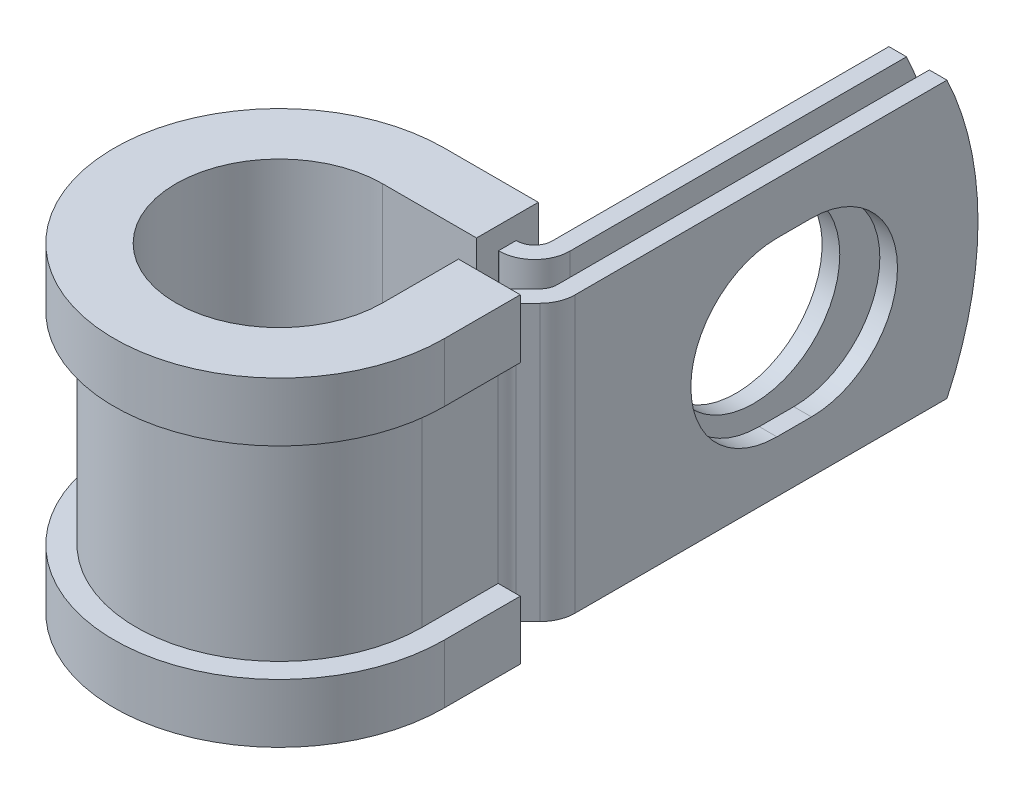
ISO-10303-21;
HEADER;
FILE_DESCRIPTION(('STEP AP214'),'2;1');
FILE_NAME('part.step','',(''),(''),'','','');
FILE_SCHEMA(('AUTOMOTIVE_DESIGN { 1 0 10303 214 1 1 1 1 }'));
ENDSEC;
DATA;
#1=APPLICATION_CONTEXT('core data for automotive mechanical design processes');
#2=APPLICATION_PROTOCOL_DEFINITION('international standard','automotive_design',2000,#1);
#3=PRODUCT_CONTEXT('',#1,'mechanical');
#4=PRODUCT('Part','Part','',(#3));
#5=PRODUCT_RELATED_PRODUCT_CATEGORY('part','',(#4));
#6=PRODUCT_DEFINITION_FORMATION('','',#4);
#7=PRODUCT_DEFINITION_CONTEXT('part definition',#1,'design');
#8=PRODUCT_DEFINITION('design','',#6,#7);
#9=PRODUCT_DEFINITION_SHAPE('','',#8);
#10=(LENGTH_UNIT() NAMED_UNIT(*) SI_UNIT(.MILLI.,.METRE.));
#11=(NAMED_UNIT(*) PLANE_ANGLE_UNIT() SI_UNIT($,.RADIAN.));
#12=(NAMED_UNIT(*) SI_UNIT($,.STERADIAN.) SOLID_ANGLE_UNIT());
#13=UNCERTAINTY_MEASURE_WITH_UNIT(LENGTH_MEASURE(1.E-05),#10,'distance_accuracy_value','');
#14=(GEOMETRIC_REPRESENTATION_CONTEXT(3) GLOBAL_UNCERTAINTY_ASSIGNED_CONTEXT((#13)) GLOBAL_UNIT_ASSIGNED_CONTEXT((#10,
#11,#12)) REPRESENTATION_CONTEXT('',''));
#15=CARTESIAN_POINT('',(0.,0.,0.));
#16=DIRECTION('',(0.,0.,1.));
#17=DIRECTION('',(1.,0.,0.));
#18=AXIS2_PLACEMENT_3D('',#15,#16,#17);
#19=CARTESIAN_POINT('',(9.33966980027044,-9.525,-8.6614));
#20=DIRECTION('',(0.,1.,0.));
#21=DIRECTION('',(1.,0.,0.));
#22=AXIS2_PLACEMENT_3D('',#19,#20,#21);
#23=PLANE('',#22);
#24=DIRECTION('',(0.,0.,-1.));
#25=VECTOR('',#24,1.);
#26=CARTESIAN_POINT('',(6.49486980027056,-9.525,-8.6614));
#27=LINE('',#26,#25);
#28=CARTESIAN_POINT('',(6.49486980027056,-9.525,-8.6614));
#29=VERTEX_POINT('',#28);
#30=CARTESIAN_POINT('',(6.49486980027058,-9.525,-9.8806));
#31=VERTEX_POINT('',#30);
#32=EDGE_CURVE('E524',#29,#31,#27,.T.);
#33=ORIENTED_EDGE('',*,*,#32,.T.);
#34=DIRECTION('',(1.,0.,0.));
#35=VECTOR('',#34,1.);
#36=CARTESIAN_POINT('',(0.,-9.525,-9.8806));
#37=LINE('',#36,#35);
#38=CARTESIAN_POINT('',(6.54566980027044,-9.525,-9.8806));
#39=VERTEX_POINT('',#38);
#40=EDGE_CURVE('E411',#39,#31,#37,.F.);
#41=ORIENTED_EDGE('',*,*,#40,.F.);
#42=CARTESIAN_POINT('',(6.54566980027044,-9.525,-11.0998));
#43=DIRECTION('',(0.,1.,0.));
#44=DIRECTION('',(1.,0.,0.));
#45=AXIS2_PLACEMENT_3D('',#42,#43,#44);
#46=CIRCLE('',#45,1.2192);
#47=CARTESIAN_POINT('',(7.76486980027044,-9.525,-11.0998));
#48=VERTEX_POINT('',#47);
#49=EDGE_CURVE('E409',#48,#39,#46,.F.);
#50=ORIENTED_EDGE('',*,*,#49,.F.);
#51=DIRECTION('',(0.,0.,1.));
#52=VECTOR('',#51,1.);
#53=CARTESIAN_POINT('',(7.76486980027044,-9.525,-36.4998));
#54=LINE('',#53,#52);
#55=CARTESIAN_POINT('',(7.76486980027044,-9.525,-34.3552631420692));
#56=VERTEX_POINT('',#55);
#57=EDGE_CURVE('E407',#56,#48,#54,.T.);
#58=ORIENTED_EDGE('',*,*,#57,.F.);
#59=DIRECTION('',(-1.,0.,0.));
#60=VECTOR('',#59,1.);
#61=CARTESIAN_POINT('',(11.7780698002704,-9.525,-34.3552631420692));
#62=LINE('',#61,#60);
#63=CARTESIAN_POINT('',(8.98406980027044,-9.525,-34.3552631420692));
#64=VERTEX_POINT('',#63);
#65=EDGE_CURVE('E12',#64,#56,#62,.T.);
#66=ORIENTED_EDGE('',*,*,#65,.F.);
#67=DIRECTION('',(0.,0.,1.));
#68=VECTOR('',#67,1.);
#69=CARTESIAN_POINT('',(8.98406980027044,-9.525,-36.4998));
#70=LINE('',#69,#68);
#71=CARTESIAN_POINT('',(8.98406980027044,-9.525,-11.0998));
#72=VERTEX_POINT('',#71);
#73=EDGE_CURVE('E405',#64,#72,#70,.T.);
#74=ORIENTED_EDGE('',*,*,#73,.T.);
#75=CARTESIAN_POINT('',(6.54566980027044,-9.525,-11.0998));
#76=DIRECTION('',(0.,-1.,0.));
#77=DIRECTION('',(0.,0.,1.));
#78=AXIS2_PLACEMENT_3D('',#75,#76,#77);
#79=CIRCLE('',#78,2.4384);
#80=CARTESIAN_POINT('',(6.54566980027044,-9.525,-8.6614));
#81=VERTEX_POINT('',#80);
#82=EDGE_CURVE('E402',#72,#81,#79,.T.);
#83=ORIENTED_EDGE('',*,*,#82,.T.);
#84=DIRECTION('',(-1.,0.,0.));
#85=VECTOR('',#84,1.);
#86=CARTESIAN_POINT('',(0.,-9.525,-8.6614));
#87=LINE('',#86,#85);
#88=EDGE_CURVE('E399',#81,#29,#87,.T.);
#89=ORIENTED_EDGE('',*,*,#88,.T.);
#90=EDGE_LOOP('',(#33,#41,#50,#58,#66,#74,#83,#89));
#91=FACE_BOUND('',#90,.T.);
#92=ADVANCED_FACE('F55',(#91),#23,.F.);
#93=CARTESIAN_POINT('',(9.33966980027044,9.525,-8.6614));
#94=DIRECTION('',(0.,1.,0.));
#95=DIRECTION('',(1.,0.,0.));
#96=AXIS2_PLACEMENT_3D('',#93,#94,#95);
#97=PLANE('',#96);
#98=DIRECTION('',(1.,0.,0.));
#99=VECTOR('',#98,1.);
#100=CARTESIAN_POINT('',(0.,9.525,-9.8806));
#101=LINE('',#100,#99);
#102=CARTESIAN_POINT('',(6.54566980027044,9.525,-9.8806));
#103=VERTEX_POINT('',#102);
#104=CARTESIAN_POINT('',(6.49486980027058,9.525,-9.8806));
#105=VERTEX_POINT('',#104);
#106=EDGE_CURVE('E369',#103,#105,#101,.F.);
#107=ORIENTED_EDGE('',*,*,#106,.T.);
#108=DIRECTION('',(0.,0.,1.));
#109=VECTOR('',#108,1.);
#110=CARTESIAN_POINT('',(6.49486980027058,9.525,-9.8806));
#111=LINE('',#110,#109);
#112=CARTESIAN_POINT('',(6.49486980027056,9.525,-8.6614));
#113=VERTEX_POINT('',#112);
#114=EDGE_CURVE('E518',#105,#113,#111,.T.);
#115=ORIENTED_EDGE('',*,*,#114,.T.);
#116=DIRECTION('',(-1.,0.,0.));
#117=VECTOR('',#116,1.);
#118=CARTESIAN_POINT('',(0.,9.525,-8.6614));
#119=LINE('',#118,#117);
#120=CARTESIAN_POINT('',(6.54566980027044,9.525,-8.6614));
#121=VERTEX_POINT('',#120);
#122=EDGE_CURVE('E626',#121,#113,#119,.T.);
#123=ORIENTED_EDGE('',*,*,#122,.F.);
#124=CARTESIAN_POINT('',(6.54566980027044,9.525,-11.0998));
#125=DIRECTION('',(0.,-1.,0.));
#126=DIRECTION('',(0.,0.,1.));
#127=AXIS2_PLACEMENT_3D('',#124,#125,#126);
#128=CIRCLE('',#127,2.4384);
#129=CARTESIAN_POINT('',(8.98406980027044,9.525,-11.0998));
#130=VERTEX_POINT('',#129);
#131=EDGE_CURVE('E371',#130,#121,#128,.T.);
#132=ORIENTED_EDGE('',*,*,#131,.F.);
#133=DIRECTION('',(0.,0.,1.));
#134=VECTOR('',#133,1.);
#135=CARTESIAN_POINT('',(8.98406980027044,9.525,-36.4998));
#136=LINE('',#135,#134);
#137=CARTESIAN_POINT('',(8.98406980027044,9.525,-34.3552631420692));
#138=VERTEX_POINT('',#137);
#139=EDGE_CURVE('E362',#138,#130,#136,.T.);
#140=ORIENTED_EDGE('',*,*,#139,.F.);
#141=DIRECTION('',(-1.,0.,0.));
#142=VECTOR('',#141,1.);
#143=CARTESIAN_POINT('',(11.7780698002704,9.525,-34.3552631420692));
#144=LINE('',#143,#142);
#145=CARTESIAN_POINT('',(7.76486980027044,9.525,-34.3552631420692));
#146=VERTEX_POINT('',#145);
#147=EDGE_CURVE('E63',#138,#146,#144,.T.);
#148=ORIENTED_EDGE('',*,*,#147,.T.);
#149=DIRECTION('',(0.,0.,1.));
#150=VECTOR('',#149,1.);
#151=CARTESIAN_POINT('',(7.76486980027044,9.525,-36.4998));
#152=LINE('',#151,#150);
#153=CARTESIAN_POINT('',(7.76486980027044,9.525,-11.0998));
#154=VERTEX_POINT('',#153);
#155=EDGE_CURVE('E359',#146,#154,#152,.T.);
#156=ORIENTED_EDGE('',*,*,#155,.T.);
#157=CARTESIAN_POINT('',(6.54566980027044,9.525,-11.0998));
#158=DIRECTION('',(0.,1.,0.));
#159=DIRECTION('',(1.,0.,0.));
#160=AXIS2_PLACEMENT_3D('',#157,#158,#159);
#161=CIRCLE('',#160,1.2192);
#162=EDGE_CURVE('E367',#154,#103,#161,.F.);
#163=ORIENTED_EDGE('',*,*,#162,.T.);
#164=EDGE_LOOP('',(#107,#115,#123,#132,#140,#148,#156,#163));
#165=FACE_BOUND('',#164,.T.);
#166=ADVANCED_FACE('F358',(#165),#97,.T.);
#167=CARTESIAN_POINT('',(0.,9.525,-8.6614));
#168=DIRECTION('',(0.,0.,1.));
#169=DIRECTION('',(1.,0.,0.));
#170=AXIS2_PLACEMENT_3D('',#167,#168,#169);
#171=PLANE('',#170);
#172=ORIENTED_EDGE('',*,*,#122,.T.);
#173=DIRECTION('',(0.,-1.,0.));
#174=VECTOR('',#173,1.);
#175=CARTESIAN_POINT('',(6.49486980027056,9.525,-8.6614));
#176=LINE('',#175,#174);
#177=EDGE_CURVE('E521',#113,#29,#176,.T.);
#178=ORIENTED_EDGE('',*,*,#177,.T.);
#179=ORIENTED_EDGE('',*,*,#88,.F.);
#180=DIRECTION('',(0.,-1.,0.));
#181=VECTOR('',#180,1.);
#182=CARTESIAN_POINT('',(6.54566980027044,9.525,-8.6614));
#183=LINE('',#182,#181);
#184=EDGE_CURVE('E345',#121,#81,#183,.T.);
#185=ORIENTED_EDGE('',*,*,#184,.F.);
#186=EDGE_LOOP('',(#172,#178,#179,#185));
#187=FACE_BOUND('',#186,.T.);
#188=ADVANCED_FACE('F636',(#187),#171,.T.);
#189=CARTESIAN_POINT('',(11.7780698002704,9.525,-8.6614));
#190=DIRECTION('',(-1.,0.,0.));
#191=DIRECTION('',(0.,0.,1.));
#192=AXIS2_PLACEMENT_3D('',#189,#190,#191);
#193=PLANE('',#192);
#194=CARTESIAN_POINT('',(11.7780698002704,0.,-24.9935999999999));
#195=DIRECTION('',(1.,0.,0.));
#196=DIRECTION('',(0.,0.,-1.));
#197=AXIS2_PLACEMENT_3D('',#194,#195,#196);
#198=CIRCLE('',#197,5.9436);
#199=CARTESIAN_POINT('',(11.7780698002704,-5.9436,-24.9936000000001));
#200=VERTEX_POINT('',#199);
#201=CARTESIAN_POINT('',(11.7780698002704,5.9436,-24.9936000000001));
#202=VERTEX_POINT('',#201);
#203=EDGE_CURVE('E581',#200,#202,#198,.T.);
#204=ORIENTED_EDGE('',*,*,#203,.F.);
#205=DIRECTION('',(0.,0.,-1.));
#206=VECTOR('',#205,1.);
#207=CARTESIAN_POINT('',(11.7780698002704,-5.9436,-22.6059999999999));
#208=LINE('',#207,#206);
#209=CARTESIAN_POINT('',(11.7780698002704,-5.9436,-22.6059999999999));
#210=VERTEX_POINT('',#209);
#211=EDGE_CURVE('E584',#210,#200,#208,.T.);
#212=ORIENTED_EDGE('',*,*,#211,.F.);
#213=CARTESIAN_POINT('',(11.7780698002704,0.,-22.6059999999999));
#214=DIRECTION('',(1.,0.,0.));
#215=DIRECTION('',(0.,0.,-1.));
#216=AXIS2_PLACEMENT_3D('',#213,#214,#215);
#217=CIRCLE('',#216,5.9436);
#218=CARTESIAN_POINT('',(11.7780698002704,5.9436,-22.6059999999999));
#219=VERTEX_POINT('',#218);
#220=EDGE_CURVE('E577',#219,#210,#217,.T.);
#221=ORIENTED_EDGE('',*,*,#220,.F.);
#222=DIRECTION('',(0.,0.,1.));
#223=VECTOR('',#222,1.);
#224=CARTESIAN_POINT('',(11.7780698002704,5.9436,-22.6059999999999));
#225=LINE('',#224,#223);
#226=EDGE_CURVE('E578',#202,#219,#225,.T.);
#227=ORIENTED_EDGE('',*,*,#226,.F.);
#228=EDGE_LOOP('',(#204,#212,#221,#227));
#229=FACE_BOUND('',#228,.T.);
#230=DIRECTION('',(0.,0.,-1.));
#231=VECTOR('',#230,1.);
#232=CARTESIAN_POINT('',(11.7780698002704,-9.525,-8.6614));
#233=LINE('',#232,#231);
#234=CARTESIAN_POINT('',(11.7780698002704,-9.525,-8.6614));
#235=VERTEX_POINT('',#234);
#236=CARTESIAN_POINT('',(11.7780698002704,-9.525,-34.3552631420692));
#237=VERTEX_POINT('',#236);
#238=EDGE_CURVE('E383',#235,#237,#233,.T.);
#239=ORIENTED_EDGE('',*,*,#238,.T.);
#240=CARTESIAN_POINT('',(11.7780698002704,0.,-14.2748));
#241=DIRECTION('',(-1.,0.,0.));
#242=DIRECTION('',(0.,0.,1.));
#243=AXIS2_PLACEMENT_3D('',#240,#241,#242);
#244=CIRCLE('',#243,22.225);
#245=CARTESIAN_POINT('',(11.7780698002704,9.525,-34.3552631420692));
#246=VERTEX_POINT('',#245);
#247=EDGE_CURVE('E569',#246,#237,#244,.T.);
#248=ORIENTED_EDGE('',*,*,#247,.F.);
#249=DIRECTION('',(0.,0.,-1.));
#250=VECTOR('',#249,1.);
#251=CARTESIAN_POINT('',(11.7780698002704,9.525,-8.6614));
#252=LINE('',#251,#250);
#253=CARTESIAN_POINT('',(11.7780698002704,9.525,-8.6614));
#254=VERTEX_POINT('',#253);
#255=EDGE_CURVE('E420',#254,#246,#252,.T.);
#256=ORIENTED_EDGE('',*,*,#255,.F.);
#257=DIRECTION('',(0.,-1.,0.));
#258=VECTOR('',#257,1.);
#259=CARTESIAN_POINT('',(11.7780698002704,9.525,-8.6614));
#260=LINE('',#259,#258);
#261=EDGE_CURVE('E382',#254,#235,#260,.T.);
#262=ORIENTED_EDGE('',*,*,#261,.T.);
#263=EDGE_LOOP('',(#239,#248,#256,#262));
#264=FACE_BOUND('',#263,.T.);
#265=ADVANCED_FACE('F57',(#229,#264),#193,.F.);
#266=CARTESIAN_POINT('',(10.5588698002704,9.525,-8.6614));
#267=DIRECTION('',(-1.,0.,0.));
#268=DIRECTION('',(0.,0.,1.));
#269=AXIS2_PLACEMENT_3D('',#266,#267,#268);
#270=PLANE('',#269);
#271=DIRECTION('',(0.,0.,-1.));
#272=VECTOR('',#271,1.);
#273=CARTESIAN_POINT('',(10.5588698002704,-5.9436,-22.6059999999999));
#274=LINE('',#273,#272);
#275=CARTESIAN_POINT('',(10.5588698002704,-5.9436,-22.6059999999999));
#276=VERTEX_POINT('',#275);
#277=CARTESIAN_POINT('',(10.5588698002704,-5.9436,-24.9936000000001));
#278=VERTEX_POINT('',#277);
#279=EDGE_CURVE('E580',#276,#278,#274,.T.);
#280=ORIENTED_EDGE('',*,*,#279,.T.);
#281=CARTESIAN_POINT('',(10.5588698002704,0.,-24.9935999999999));
#282=DIRECTION('',(-1.,0.,0.));
#283=DIRECTION('',(0.,0.,1.));
#284=AXIS2_PLACEMENT_3D('',#281,#282,#283);
#285=CIRCLE('',#284,5.9436);
#286=CARTESIAN_POINT('',(10.5588698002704,5.9436,-24.9936000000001));
#287=VERTEX_POINT('',#286);
#288=EDGE_CURVE('E601',#278,#287,#285,.F.);
#289=ORIENTED_EDGE('',*,*,#288,.T.);
#290=DIRECTION('',(0.,0.,1.));
#291=VECTOR('',#290,1.);
#292=CARTESIAN_POINT('',(10.5588698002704,5.9436,-22.6059999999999));
#293=LINE('',#292,#291);
#294=CARTESIAN_POINT('',(10.5588698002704,5.9436,-22.6059999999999));
#295=VERTEX_POINT('',#294);
#296=EDGE_CURVE('E597',#287,#295,#293,.T.);
#297=ORIENTED_EDGE('',*,*,#296,.T.);
#298=CARTESIAN_POINT('',(10.5588698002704,0.,-22.6059999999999));
#299=DIRECTION('',(-1.,0.,0.));
#300=DIRECTION('',(0.,0.,1.));
#301=AXIS2_PLACEMENT_3D('',#298,#299,#300);
#302=CIRCLE('',#301,5.9436);
#303=EDGE_CURVE('E592',#295,#276,#302,.F.);
#304=ORIENTED_EDGE('',*,*,#303,.T.);
#305=EDGE_LOOP('',(#280,#289,#297,#304));
#306=FACE_BOUND('',#305,.T.);
#307=CARTESIAN_POINT('',(10.5588698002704,0.,-14.2748));
#308=DIRECTION('',(-1.,0.,0.));
#309=DIRECTION('',(0.,0.,1.));
#310=AXIS2_PLACEMENT_3D('',#307,#308,#309);
#311=CIRCLE('',#310,22.225);
#312=CARTESIAN_POINT('',(10.5588698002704,9.525,-34.3552631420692));
#313=VERTEX_POINT('',#312);
#314=CARTESIAN_POINT('',(10.5588698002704,-9.525,-34.3552631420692));
#315=VERTEX_POINT('',#314);
#316=EDGE_CURVE('E77',#313,#315,#311,.T.);
#317=ORIENTED_EDGE('',*,*,#316,.T.);
#318=DIRECTION('',(0.,0.,-1.));
#319=VECTOR('',#318,1.);
#320=CARTESIAN_POINT('',(10.5588698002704,-9.525,-8.6614));
#321=LINE('',#320,#319);
#322=CARTESIAN_POINT('',(10.5588698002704,-9.525,-8.6614));
#323=VERTEX_POINT('',#322);
#324=EDGE_CURVE('E386',#323,#315,#321,.T.);
#325=ORIENTED_EDGE('',*,*,#324,.F.);
#326=DIRECTION('',(0.,-1.,0.));
#327=VECTOR('',#326,1.);
#328=CARTESIAN_POINT('',(10.5588698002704,9.525,-8.6614));
#329=LINE('',#328,#327);
#330=CARTESIAN_POINT('',(10.5588698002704,9.525,-8.6614));
#331=VERTEX_POINT('',#330);
#332=EDGE_CURVE('E353',#331,#323,#329,.T.);
#333=ORIENTED_EDGE('',*,*,#332,.F.);
#334=DIRECTION('',(0.,0.,-1.));
#335=VECTOR('',#334,1.);
#336=CARTESIAN_POINT('',(10.5588698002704,9.525,-8.6614));
#337=LINE('',#336,#335);
#338=EDGE_CURVE('E616',#331,#313,#337,.T.);
#339=ORIENTED_EDGE('',*,*,#338,.T.);
#340=EDGE_LOOP('',(#317,#325,#333,#339));
#341=FACE_BOUND('',#340,.T.);
#342=ADVANCED_FACE('F690',(#306,#341),#270,.T.);
#343=CARTESIAN_POINT('',(8.98406980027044,9.525,-36.4998));
#344=DIRECTION('',(1.,0.,0.));
#345=DIRECTION('',(0.,0.,-1.));
#346=AXIS2_PLACEMENT_3D('',#343,#344,#345);
#347=PLANE('',#346);
#348=CARTESIAN_POINT('',(8.98406980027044,0.,-23.7998));
#349=DIRECTION('',(1.,0.,0.));
#350=DIRECTION('',(0.,0.,-1.));
#351=AXIS2_PLACEMENT_3D('',#348,#349,#350);
#352=CIRCLE('',#351,5.9436);
#353=CARTESIAN_POINT('',(8.98406980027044,0.,-29.7434));
#354=VERTEX_POINT('',#353);
#355=EDGE_CURVE('E387',#354,#354,#352,.F.);
#356=ORIENTED_EDGE('',*,*,#355,.T.);
#357=EDGE_LOOP('',(#356));
#358=FACE_BOUND('',#357,.T.);
#359=ORIENTED_EDGE('',*,*,#73,.F.);
#360=CARTESIAN_POINT('',(8.98406980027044,0.,-14.2748));
#361=DIRECTION('',(1.,0.,0.));
#362=DIRECTION('',(0.,0.,-1.));
#363=AXIS2_PLACEMENT_3D('',#360,#361,#362);
#364=CIRCLE('',#363,22.225);
#365=EDGE_CURVE('E574',#64,#138,#364,.T.);
#366=ORIENTED_EDGE('',*,*,#365,.T.);
#367=ORIENTED_EDGE('',*,*,#139,.T.);
#368=DIRECTION('',(0.,-1.,0.));
#369=VECTOR('',#368,1.);
#370=CARTESIAN_POINT('',(8.98406980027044,9.525,-11.0998));
#371=LINE('',#370,#369);
#372=EDGE_CURVE('E342',#130,#72,#371,.T.);
#373=ORIENTED_EDGE('',*,*,#372,.T.);
#374=EDGE_LOOP('',(#359,#366,#367,#373));
#375=FACE_BOUND('',#374,.T.);
#376=ADVANCED_FACE('F642',(#358,#375),#347,.T.);
#377=CARTESIAN_POINT('',(7.76486980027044,9.525,-36.4998));
#378=DIRECTION('',(1.,0.,0.));
#379=DIRECTION('',(0.,0.,-1.));
#380=AXIS2_PLACEMENT_3D('',#377,#378,#379);
#381=PLANE('',#380);
#382=CARTESIAN_POINT('',(7.76486980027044,0.,-23.7998));
#383=DIRECTION('',(-1.,0.,0.));
#384=DIRECTION('',(0.,0.,1.));
#385=AXIS2_PLACEMENT_3D('',#382,#383,#384);
#386=CIRCLE('',#385,5.9436);
#387=CARTESIAN_POINT('',(7.76486980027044,0.,-17.8562));
#388=VERTEX_POINT('',#387);
#389=EDGE_CURVE('E609',#388,#388,#386,.T.);
#390=ORIENTED_EDGE('',*,*,#389,.F.);
#391=EDGE_LOOP('',(#390));
#392=FACE_BOUND('',#391,.T.);
#393=CARTESIAN_POINT('',(7.76486980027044,0.,-14.2748));
#394=DIRECTION('',(-1.,0.,0.));
#395=DIRECTION('',(0.,0.,1.));
#396=AXIS2_PLACEMENT_3D('',#393,#394,#395);
#397=CIRCLE('',#396,22.225);
#398=EDGE_CURVE('E69',#146,#56,#397,.T.);
#399=ORIENTED_EDGE('',*,*,#398,.T.);
#400=ORIENTED_EDGE('',*,*,#57,.T.);
#401=DIRECTION('',(0.,-1.,0.));
#402=VECTOR('',#401,1.);
#403=CARTESIAN_POINT('',(7.76486980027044,9.525,-11.0998));
#404=LINE('',#403,#402);
#405=EDGE_CURVE('E339',#154,#48,#404,.T.);
#406=ORIENTED_EDGE('',*,*,#405,.F.);
#407=ORIENTED_EDGE('',*,*,#155,.F.);
#408=EDGE_LOOP('',(#399,#400,#406,#407));
#409=FACE_BOUND('',#408,.T.);
#410=ADVANCED_FACE('F365',(#392,#409),#381,.F.);
#411=CARTESIAN_POINT('',(11.0998,-9.525,-5.24890267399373));
#412=DIRECTION('',(0.,1.,0.));
#413=DIRECTION('',(1.,0.,0.));
#414=AXIS2_PLACEMENT_3D('',#411,#412,#413);
#415=CIRCLE('',#414,1.2192);
#416=CARTESIAN_POINT('',(9.8806,-9.525,-5.24890267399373));
#417=VERTEX_POINT('',#416);
#418=CARTESIAN_POINT('',(10.2376954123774,-9.525,-6.11100726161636));
#419=VERTEX_POINT('',#418);
#420=EDGE_CURVE('E414',#417,#419,#415,.F.);
#421=ORIENTED_EDGE('',*,*,#420,.F.);
#422=DIRECTION('',(1.,0.,0.));
#423=VECTOR('',#422,1.);
#424=CARTESIAN_POINT('',(8.6614,-9.525,-5.24890267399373));
#425=LINE('',#424,#423);
#426=CARTESIAN_POINT('',(8.6614,-9.525,-5.24890267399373));
#427=VERTEX_POINT('',#426);
#428=EDGE_CURVE('E452',#427,#417,#425,.T.);
#429=ORIENTED_EDGE('',*,*,#428,.F.);
#430=CARTESIAN_POINT('',(11.0998,-9.525,-5.24890267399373));
#431=DIRECTION('',(0.,-1.,0.));
#432=DIRECTION('',(0.,0.,1.));
#433=AXIS2_PLACEMENT_3D('',#430,#431,#432);
#434=CIRCLE('',#433,2.4384);
#435=CARTESIAN_POINT('',(9.37559082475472,-9.525,-6.973111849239));
#436=VERTEX_POINT('',#435);
#437=EDGE_CURVE('E396',#427,#436,#434,.T.);
#438=ORIENTED_EDGE('',*,*,#437,.T.);
#439=DIRECTION('',(0.707106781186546,0.,-0.707106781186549));
#440=VECTOR('',#439,1.);
#441=CARTESIAN_POINT('',(9.37559082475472,-9.525,-6.973111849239));
#442=LINE('',#441,#440);
#443=CARTESIAN_POINT('',(10.2017743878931,-9.525,-7.79929541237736));
#444=VERTEX_POINT('',#443);
#445=EDGE_CURVE('E393',#436,#444,#442,.T.);
#446=ORIENTED_EDGE('',*,*,#445,.T.);
#447=CARTESIAN_POINT('',(9.33966980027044,-9.525,-8.6614));
#448=DIRECTION('',(0.,1.,0.));
#449=DIRECTION('',(0.,0.,1.));
#450=AXIS2_PLACEMENT_3D('',#447,#448,#449);
#451=CIRCLE('',#450,1.2192);
#452=EDGE_CURVE('E390',#444,#323,#451,.T.);
#453=ORIENTED_EDGE('',*,*,#452,.T.);
#454=ORIENTED_EDGE('',*,*,#324,.T.);
#455=DIRECTION('',(-1.,0.,0.));
#456=VECTOR('',#455,1.);
#457=CARTESIAN_POINT('',(11.7780698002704,-9.525,-34.3552631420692));
#458=LINE('',#457,#456);
#459=EDGE_CURVE('E567',#237,#315,#458,.T.);
#460=ORIENTED_EDGE('',*,*,#459,.F.);
#461=ORIENTED_EDGE('',*,*,#238,.F.);
#462=CARTESIAN_POINT('',(9.33966980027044,-9.525,-8.6614));
#463=DIRECTION('',(0.,1.,0.));
#464=DIRECTION('',(1.,0.,0.));
#465=AXIS2_PLACEMENT_3D('',#462,#463,#464);
#466=CIRCLE('',#465,2.4384);
#467=CARTESIAN_POINT('',(11.0638789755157,-9.525,-6.93719082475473));
#468=VERTEX_POINT('',#467);
#469=EDGE_CURVE('E418',#468,#235,#466,.T.);
#470=ORIENTED_EDGE('',*,*,#469,.F.);
#471=DIRECTION('',(0.707106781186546,0.,-0.707106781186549));
#472=VECTOR('',#471,1.);
#473=CARTESIAN_POINT('',(10.2376954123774,-9.525,-6.11100726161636));
#474=LINE('',#473,#472);
#475=EDGE_CURVE('E416',#419,#468,#474,.T.);
#476=ORIENTED_EDGE('',*,*,#475,.F.);
#477=EDGE_LOOP('',(#421,#429,#438,#446,#453,#454,#460,#461,#470,#476));
#478=FACE_BOUND('',#477,.T.);
#479=ADVANCED_FACE('F676',(#478),#23,.F.);
#480=DIRECTION('',(-1.,0.,0.));
#481=VECTOR('',#480,1.);
#482=CARTESIAN_POINT('',(9.8806,9.525,-5.24890267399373));
#483=LINE('',#482,#481);
#484=CARTESIAN_POINT('',(9.8806,9.525,-5.24890267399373));
#485=VERTEX_POINT('',#484);
#486=CARTESIAN_POINT('',(8.6614,9.525,-5.24890267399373));
#487=VERTEX_POINT('',#486);
#488=EDGE_CURVE('E441',#485,#487,#483,.T.);
#489=ORIENTED_EDGE('',*,*,#488,.F.);
#490=CARTESIAN_POINT('',(11.0998,9.525,-5.24890267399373));
#491=DIRECTION('',(0.,1.,0.));
#492=DIRECTION('',(1.,0.,0.));
#493=AXIS2_PLACEMENT_3D('',#490,#491,#492);
#494=CIRCLE('',#493,1.2192);
#495=CARTESIAN_POINT('',(10.2376954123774,9.525,-6.11100726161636));
#496=VERTEX_POINT('',#495);
#497=EDGE_CURVE('E376',#485,#496,#494,.F.);
#498=ORIENTED_EDGE('',*,*,#497,.T.);
#499=DIRECTION('',(0.707106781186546,0.,-0.707106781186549));
#500=VECTOR('',#499,1.);
#501=CARTESIAN_POINT('',(10.2376954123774,9.525,-6.11100726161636));
#502=LINE('',#501,#500);
#503=CARTESIAN_POINT('',(11.0638789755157,9.525,-6.93719082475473));
#504=VERTEX_POINT('',#503);
#505=EDGE_CURVE('E378',#496,#504,#502,.T.);
#506=ORIENTED_EDGE('',*,*,#505,.T.);
#507=CARTESIAN_POINT('',(9.33966980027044,9.525,-8.6614));
#508=DIRECTION('',(0.,1.,0.));
#509=DIRECTION('',(1.,0.,0.));
#510=AXIS2_PLACEMENT_3D('',#507,#508,#509);
#511=CIRCLE('',#510,2.4384);
#512=EDGE_CURVE('E380',#504,#254,#511,.T.);
#513=ORIENTED_EDGE('',*,*,#512,.T.);
#514=ORIENTED_EDGE('',*,*,#255,.T.);
#515=DIRECTION('',(-1.,0.,0.));
#516=VECTOR('',#515,1.);
#517=CARTESIAN_POINT('',(11.7780698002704,9.525,-34.3552631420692));
#518=LINE('',#517,#516);
#519=EDGE_CURVE('E571',#246,#313,#518,.T.);
#520=ORIENTED_EDGE('',*,*,#519,.T.);
#521=ORIENTED_EDGE('',*,*,#338,.F.);
#522=CARTESIAN_POINT('',(9.33966980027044,9.525,-8.6614));
#523=DIRECTION('',(0.,1.,0.));
#524=DIRECTION('',(0.,0.,1.));
#525=AXIS2_PLACEMENT_3D('',#522,#523,#524);
#526=CIRCLE('',#525,1.2192);
#527=CARTESIAN_POINT('',(10.2017743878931,9.525,-7.79929541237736));
#528=VERTEX_POINT('',#527);
#529=EDGE_CURVE('E619',#528,#331,#526,.T.);
#530=ORIENTED_EDGE('',*,*,#529,.F.);
#531=DIRECTION('',(0.707106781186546,0.,-0.707106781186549));
#532=VECTOR('',#531,1.);
#533=CARTESIAN_POINT('',(9.37559082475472,9.525,-6.973111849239));
#534=LINE('',#533,#532);
#535=CARTESIAN_POINT('',(9.37559082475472,9.525,-6.973111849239));
#536=VERTEX_POINT('',#535);
#537=EDGE_CURVE('E622',#536,#528,#534,.T.);
#538=ORIENTED_EDGE('',*,*,#537,.F.);
#539=CARTESIAN_POINT('',(11.0998,9.525,-5.24890267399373));
#540=DIRECTION('',(0.,-1.,0.));
#541=DIRECTION('',(0.,0.,1.));
#542=AXIS2_PLACEMENT_3D('',#539,#540,#541);
#543=CIRCLE('',#542,2.4384);
#544=EDGE_CURVE('E451',#487,#536,#543,.T.);
#545=ORIENTED_EDGE('',*,*,#544,.F.);
#546=EDGE_LOOP('',(#489,#498,#506,#513,#514,#520,#521,#530,#538,#545));
#547=FACE_BOUND('',#546,.T.);
#548=ADVANCED_FACE('F448',(#547),#97,.T.);
#549=CARTESIAN_POINT('',(9.33966980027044,9.525,-8.6614));
#550=DIRECTION('',(0.,-1.,0.));
#551=DIRECTION('',(0.,0.,-1.));
#552=AXIS2_PLACEMENT_3D('',#549,#550,#551);
#553=CYLINDRICAL_SURFACE('',#552,1.2192);
#554=ORIENTED_EDGE('',*,*,#452,.F.);
#555=DIRECTION('',(0.,-1.,0.));
#556=VECTOR('',#555,1.);
#557=CARTESIAN_POINT('',(10.2017743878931,9.525,-7.79929541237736));
#558=LINE('',#557,#556);
#559=EDGE_CURVE('E351',#528,#444,#558,.T.);
#560=ORIENTED_EDGE('',*,*,#559,.F.);
#561=ORIENTED_EDGE('',*,*,#529,.T.);
#562=ORIENTED_EDGE('',*,*,#332,.T.);
#563=EDGE_LOOP('',(#554,#560,#561,#562));
#564=FACE_BOUND('',#563,.T.);
#565=ADVANCED_FACE('F686',(#564),#553,.F.);
#566=CARTESIAN_POINT('',(9.37559082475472,9.525,-6.973111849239));
#567=DIRECTION('',(-0.707106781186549,0.,-0.707106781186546));
#568=DIRECTION('',(-0.707106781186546,0.,0.707106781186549));
#569=AXIS2_PLACEMENT_3D('',#566,#567,#568);
#570=PLANE('',#569);
#571=ORIENTED_EDGE('',*,*,#445,.F.);
#572=DIRECTION('',(0.,-1.,0.));
#573=VECTOR('',#572,1.);
#574=CARTESIAN_POINT('',(9.37559082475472,9.525,-6.973111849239));
#575=LINE('',#574,#573);
#576=EDGE_CURVE('E349',#536,#436,#575,.T.);
#577=ORIENTED_EDGE('',*,*,#576,.F.);
#578=ORIENTED_EDGE('',*,*,#537,.T.);
#579=ORIENTED_EDGE('',*,*,#559,.T.);
#580=EDGE_LOOP('',(#571,#577,#578,#579));
#581=FACE_BOUND('',#580,.T.);
#582=ADVANCED_FACE('F681',(#581),#570,.T.);
#583=CARTESIAN_POINT('',(11.0998,9.525,-5.24890267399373));
#584=DIRECTION('',(0.,-1.,0.));
#585=DIRECTION('',(0.,0.,-1.));
#586=AXIS2_PLACEMENT_3D('',#583,#584,#585);
#587=CYLINDRICAL_SURFACE('',#586,2.4384);
#588=ORIENTED_EDGE('',*,*,#437,.F.);
#589=DIRECTION('',(0.,-1.,0.));
#590=VECTOR('',#589,1.);
#591=CARTESIAN_POINT('',(8.6614,9.525,-5.24890267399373));
#592=LINE('',#591,#590);
#593=EDGE_CURVE('E347',#487,#427,#592,.T.);
#594=ORIENTED_EDGE('',*,*,#593,.F.);
#595=ORIENTED_EDGE('',*,*,#544,.T.);
#596=ORIENTED_EDGE('',*,*,#576,.T.);
#597=EDGE_LOOP('',(#588,#594,#595,#596));
#598=FACE_BOUND('',#597,.T.);
#599=ADVANCED_FACE('F678',(#598),#587,.T.);
#600=CARTESIAN_POINT('',(6.54566980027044,9.525,-11.0998));
#601=DIRECTION('',(0.,-1.,0.));
#602=DIRECTION('',(0.,0.,-1.));
#603=AXIS2_PLACEMENT_3D('',#600,#601,#602);
#604=CYLINDRICAL_SURFACE('',#603,2.4384);
#605=ORIENTED_EDGE('',*,*,#82,.F.);
#606=ORIENTED_EDGE('',*,*,#372,.F.);
#607=ORIENTED_EDGE('',*,*,#131,.T.);
#608=ORIENTED_EDGE('',*,*,#184,.T.);
#609=EDGE_LOOP('',(#605,#606,#607,#608));
#610=FACE_BOUND('',#609,.T.);
#611=ADVANCED_FACE('F632',(#610),#604,.T.);
#612=CARTESIAN_POINT('',(6.54566980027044,9.525,-11.0998));
#613=DIRECTION('',(0.,-1.,0.));
#614=DIRECTION('',(0.,0.,-1.));
#615=AXIS2_PLACEMENT_3D('',#612,#613,#614);
#616=CYLINDRICAL_SURFACE('',#615,1.2192);
#617=ORIENTED_EDGE('',*,*,#49,.T.);
#618=DIRECTION('',(0.,-1.,0.));
#619=VECTOR('',#618,1.);
#620=CARTESIAN_POINT('',(6.54566980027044,9.525,-9.8806));
#621=LINE('',#620,#619);
#622=EDGE_CURVE('E330',#103,#39,#621,.T.);
#623=ORIENTED_EDGE('',*,*,#622,.F.);
#624=ORIENTED_EDGE('',*,*,#162,.F.);
#625=ORIENTED_EDGE('',*,*,#405,.T.);
#626=EDGE_LOOP('',(#617,#623,#624,#625));
#627=FACE_BOUND('',#626,.T.);
#628=ADVANCED_FACE('F647',(#627),#616,.F.);
#629=CARTESIAN_POINT('',(0.,9.525,-9.8806));
#630=DIRECTION('',(0.,0.,1.));
#631=DIRECTION('',(1.,0.,0.));
#632=AXIS2_PLACEMENT_3D('',#629,#630,#631);
#633=PLANE('',#632);
#634=DIRECTION('',(0.,-1.,0.));
#635=VECTOR('',#634,1.);
#636=CARTESIAN_POINT('',(0.,9.525,-9.8806));
#637=LINE('',#636,#635);
#638=CARTESIAN_POINT('',(1.38596734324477E-13,6.985,-9.8806));
#639=VERTEX_POINT('',#638);
#640=CARTESIAN_POINT('',(1.38596734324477E-13,-6.985,-9.8806));
#641=VERTEX_POINT('',#640);
#642=EDGE_CURVE('E321',#639,#641,#637,.T.);
#643=ORIENTED_EDGE('',*,*,#642,.F.);
#644=DIRECTION('',(1.,0.,0.));
#645=VECTOR('',#644,1.);
#646=CARTESIAN_POINT('',(1.38596734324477E-13,6.985,-9.8806));
#647=LINE('',#646,#645);
#648=CARTESIAN_POINT('',(6.49486980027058,6.985,-9.8806));
#649=VERTEX_POINT('',#648);
#650=EDGE_CURVE('E564',#639,#649,#647,.T.);
#651=ORIENTED_EDGE('',*,*,#650,.T.);
#652=DIRECTION('',(0.,1.,0.));
#653=VECTOR('',#652,1.);
#654=CARTESIAN_POINT('',(6.49486980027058,9.525,-9.8806));
#655=LINE('',#654,#653);
#656=EDGE_CURVE('E515',#649,#105,#655,.T.);
#657=ORIENTED_EDGE('',*,*,#656,.T.);
#658=ORIENTED_EDGE('',*,*,#106,.F.);
#659=ORIENTED_EDGE('',*,*,#622,.T.);
#660=ORIENTED_EDGE('',*,*,#40,.T.);
#661=DIRECTION('',(0.,1.,0.));
#662=VECTOR('',#661,1.);
#663=CARTESIAN_POINT('',(6.49486980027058,-9.525,-9.8806));
#664=LINE('',#663,#662);
#665=CARTESIAN_POINT('',(6.49486980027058,-6.985,-9.8806));
#666=VERTEX_POINT('',#665);
#667=EDGE_CURVE('E527',#31,#666,#664,.T.);
#668=ORIENTED_EDGE('',*,*,#667,.T.);
#669=DIRECTION('',(1.,0.,0.));
#670=VECTOR('',#669,1.);
#671=CARTESIAN_POINT('',(1.38596734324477E-13,-6.985,-9.8806));
#672=LINE('',#671,#670);
#673=EDGE_CURVE('E544',#641,#666,#672,.T.);
#674=ORIENTED_EDGE('',*,*,#673,.F.);
#675=EDGE_LOOP('',(#643,#651,#657,#658,#659,#660,#668,#674));
#676=FACE_BOUND('',#675,.T.);
#677=ADVANCED_FACE('F651',(#676),#633,.F.);
#678=CARTESIAN_POINT('',(0.,9.525,0.));
#679=DIRECTION('',(0.,-1.,0.));
#680=DIRECTION('',(0.,0.,-1.));
#681=AXIS2_PLACEMENT_3D('',#678,#679,#680);
#682=CYLINDRICAL_SURFACE('',#681,9.8806);
#683=DIRECTION('',(0.,-1.,0.));
#684=VECTOR('',#683,1.);
#685=CARTESIAN_POINT('',(9.8806,9.525,0.));
#686=LINE('',#685,#684);
#687=CARTESIAN_POINT('',(9.8806,6.985,0.));
#688=VERTEX_POINT('',#687);
#689=CARTESIAN_POINT('',(9.8806,-6.985,0.));
#690=VERTEX_POINT('',#689);
#691=EDGE_CURVE('E319',#688,#690,#686,.T.);
#692=ORIENTED_EDGE('',*,*,#691,.F.);
#693=CARTESIAN_POINT('',(0.,6.985,0.));
#694=DIRECTION('',(0.,-1.,0.));
#695=DIRECTION('',(0.,0.,-1.));
#696=AXIS2_PLACEMENT_3D('',#693,#694,#695);
#697=CIRCLE('',#696,9.8806);
#698=EDGE_CURVE('E513',#688,#639,#697,.T.);
#699=ORIENTED_EDGE('',*,*,#698,.T.);
#700=ORIENTED_EDGE('',*,*,#642,.T.);
#701=CARTESIAN_POINT('',(0.,-6.985,0.));
#702=DIRECTION('',(0.,-1.,0.));
#703=DIRECTION('',(0.,0.,-1.));
#704=AXIS2_PLACEMENT_3D('',#701,#702,#703);
#705=CIRCLE('',#704,9.8806);
#706=EDGE_CURVE('E302',#690,#641,#705,.T.);
#707=ORIENTED_EDGE('',*,*,#706,.F.);
#708=EDGE_LOOP('',(#692,#699,#700,#707));
#709=FACE_BOUND('',#708,.T.);
#710=ADVANCED_FACE('F317',(#709),#682,.T.);
#711=CARTESIAN_POINT('',(9.8806,9.525,0.));
#712=DIRECTION('',(-1.,0.,0.));
#713=DIRECTION('',(0.,0.,1.));
#714=AXIS2_PLACEMENT_3D('',#711,#712,#713);
#715=PLANE('',#714);
#716=DIRECTION('',(0.,-1.,0.));
#717=VECTOR('',#716,1.);
#718=CARTESIAN_POINT('',(9.8806,9.525,-5.24890267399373));
#719=LINE('',#718,#717);
#720=CARTESIAN_POINT('',(9.8806,6.985,-5.24890267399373));
#721=VERTEX_POINT('',#720);
#722=CARTESIAN_POINT('',(9.8806,-6.985,-5.24890267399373));
#723=VERTEX_POINT('',#722);
#724=EDGE_CURVE('E333',#721,#723,#719,.T.);
#725=ORIENTED_EDGE('',*,*,#724,.F.);
#726=DIRECTION('',(0.,0.,-1.));
#727=VECTOR('',#726,1.);
#728=CARTESIAN_POINT('',(9.8806,6.985,0.));
#729=LINE('',#728,#727);
#730=EDGE_CURVE('E327',#688,#721,#729,.T.);
#731=ORIENTED_EDGE('',*,*,#730,.F.);
#732=ORIENTED_EDGE('',*,*,#691,.T.);
#733=DIRECTION('',(0.,0.,-1.));
#734=VECTOR('',#733,1.);
#735=CARTESIAN_POINT('',(9.8806,-6.985,0.));
#736=LINE('',#735,#734);
#737=EDGE_CURVE('E298',#690,#723,#736,.T.);
#738=ORIENTED_EDGE('',*,*,#737,.T.);
#739=EDGE_LOOP('',(#725,#731,#732,#738));
#740=FACE_BOUND('',#739,.T.);
#741=ADVANCED_FACE('F326',(#740),#715,.F.);
#742=CARTESIAN_POINT('',(11.0998,9.525,-5.24890267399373));
#743=DIRECTION('',(0.,-1.,0.));
#744=DIRECTION('',(0.,0.,-1.));
#745=AXIS2_PLACEMENT_3D('',#742,#743,#744);
#746=CYLINDRICAL_SURFACE('',#745,1.2192);
#747=ORIENTED_EDGE('',*,*,#420,.T.);
#748=DIRECTION('',(0.,-1.,0.));
#749=VECTOR('',#748,1.);
#750=CARTESIAN_POINT('',(10.2376954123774,9.525,-6.11100726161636));
#751=LINE('',#750,#749);
#752=EDGE_CURVE('E425',#496,#419,#751,.T.);
#753=ORIENTED_EDGE('',*,*,#752,.F.);
#754=ORIENTED_EDGE('',*,*,#497,.F.);
#755=EDGE_CURVE('E328',#485,#721,#719,.T.);
#756=ORIENTED_EDGE('',*,*,#755,.T.);
#757=ORIENTED_EDGE('',*,*,#724,.T.);
#758=DIRECTION('',(0.,1.,0.));
#759=VECTOR('',#758,1.);
#760=CARTESIAN_POINT('',(9.8806,-9.525,-5.24890267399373));
#761=LINE('',#760,#759);
#762=EDGE_CURVE('E434',#417,#723,#761,.T.);
#763=ORIENTED_EDGE('',*,*,#762,.F.);
#764=EDGE_LOOP('',(#747,#753,#754,#756,#757,#763));
#765=FACE_BOUND('',#764,.T.);
#766=ADVANCED_FACE('F433',(#765),#746,.F.);
#767=CARTESIAN_POINT('',(10.2376954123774,9.525,-6.11100726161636));
#768=DIRECTION('',(-0.707106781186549,0.,-0.707106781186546));
#769=DIRECTION('',(-0.707106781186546,0.,0.707106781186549));
#770=AXIS2_PLACEMENT_3D('',#767,#768,#769);
#771=PLANE('',#770);
#772=ORIENTED_EDGE('',*,*,#475,.T.);
#773=DIRECTION('',(0.,-1.,0.));
#774=VECTOR('',#773,1.);
#775=CARTESIAN_POINT('',(11.0638789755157,9.525,-6.93719082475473));
#776=LINE('',#775,#774);
#777=EDGE_CURVE('E423',#504,#468,#776,.T.);
#778=ORIENTED_EDGE('',*,*,#777,.F.);
#779=ORIENTED_EDGE('',*,*,#505,.F.);
#780=ORIENTED_EDGE('',*,*,#752,.T.);
#781=EDGE_LOOP('',(#772,#778,#779,#780));
#782=FACE_BOUND('',#781,.T.);
#783=ADVANCED_FACE('F702',(#782),#771,.F.);
#784=CARTESIAN_POINT('',(9.33966980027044,9.525,-8.6614));
#785=DIRECTION('',(0.,-1.,0.));
#786=DIRECTION('',(0.,0.,-1.));
#787=AXIS2_PLACEMENT_3D('',#784,#785,#786);
#788=CYLINDRICAL_SURFACE('',#787,2.4384);
#789=ORIENTED_EDGE('',*,*,#469,.T.);
#790=ORIENTED_EDGE('',*,*,#261,.F.);
#791=ORIENTED_EDGE('',*,*,#512,.F.);
#792=ORIENTED_EDGE('',*,*,#777,.T.);
#793=EDGE_LOOP('',(#789,#790,#791,#792));
#794=FACE_BOUND('',#793,.T.);
#795=ADVANCED_FACE('F700',(#794),#788,.T.);
#796=CARTESIAN_POINT('',(25.7951092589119,0.,-23.7998));
#797=DIRECTION('',(-1.,0.,0.));
#798=DIRECTION('',(0.,0.,1.));
#799=AXIS2_PLACEMENT_3D('',#796,#797,#798);
#800=CYLINDRICAL_SURFACE('',#799,5.9436);
#801=ORIENTED_EDGE('',*,*,#389,.T.);
#802=EDGE_LOOP('',(#801));
#803=FACE_BOUND('',#802,.T.);
#804=ORIENTED_EDGE('',*,*,#355,.F.);
#805=EDGE_LOOP('',(#804));
#806=FACE_BOUND('',#805,.T.);
#807=ADVANCED_FACE('F709',(#803,#806),#800,.F.);
#808=CARTESIAN_POINT('',(-8.0173364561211,-5.9436,-22.6059999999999));
#809=DIRECTION('',(0.,-1.,0.));
#810=DIRECTION('',(0.,0.,-1.));
#811=AXIS2_PLACEMENT_3D('',#808,#809,#810);
#812=PLANE('',#811);
#813=DIRECTION('',(1.,0.,0.));
#814=VECTOR('',#813,1.);
#815=CARTESIAN_POINT('',(-8.0173364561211,-5.9436,-22.6059999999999));
#816=LINE('',#815,#814);
#817=EDGE_CURVE('E595',#276,#210,#816,.T.);
#818=ORIENTED_EDGE('',*,*,#817,.T.);
#819=ORIENTED_EDGE('',*,*,#211,.T.);
#820=DIRECTION('',(1.,0.,0.));
#821=VECTOR('',#820,1.);
#822=CARTESIAN_POINT('',(-8.0173364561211,-5.9436,-24.9936000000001));
#823=LINE('',#822,#821);
#824=EDGE_CURVE('E591',#278,#200,#823,.T.);
#825=ORIENTED_EDGE('',*,*,#824,.F.);
#826=ORIENTED_EDGE('',*,*,#279,.F.);
#827=EDGE_LOOP('',(#818,#819,#825,#826));
#828=FACE_BOUND('',#827,.T.);
#829=ADVANCED_FACE('F752',(#828),#812,.F.);
#830=CARTESIAN_POINT('',(-8.0173364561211,0.,-24.9935999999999));
#831=DIRECTION('',(1.,0.,0.));
#832=DIRECTION('',(0.,0.,-1.));
#833=AXIS2_PLACEMENT_3D('',#830,#831,#832);
#834=CYLINDRICAL_SURFACE('',#833,5.9436);
#835=ORIENTED_EDGE('',*,*,#824,.T.);
#836=ORIENTED_EDGE('',*,*,#203,.T.);
#837=DIRECTION('',(1.,0.,0.));
#838=VECTOR('',#837,1.);
#839=CARTESIAN_POINT('',(-8.0173364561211,5.9436,-24.9936000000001));
#840=LINE('',#839,#838);
#841=EDGE_CURVE('E600',#287,#202,#840,.T.);
#842=ORIENTED_EDGE('',*,*,#841,.F.);
#843=ORIENTED_EDGE('',*,*,#288,.F.);
#844=EDGE_LOOP('',(#835,#836,#842,#843));
#845=FACE_BOUND('',#844,.T.);
#846=ADVANCED_FACE('F756',(#845),#834,.F.);
#847=CARTESIAN_POINT('',(-8.0173364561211,5.9436,-22.6059999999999));
#848=DIRECTION('',(0.,1.,0.));
#849=DIRECTION('',(0.,0.,1.));
#850=AXIS2_PLACEMENT_3D('',#847,#848,#849);
#851=PLANE('',#850);
#852=ORIENTED_EDGE('',*,*,#841,.T.);
#853=ORIENTED_EDGE('',*,*,#226,.T.);
#854=DIRECTION('',(1.,0.,0.));
#855=VECTOR('',#854,1.);
#856=CARTESIAN_POINT('',(-8.0173364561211,5.9436,-22.6059999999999));
#857=LINE('',#856,#855);
#858=EDGE_CURVE('E596',#295,#219,#857,.T.);
#859=ORIENTED_EDGE('',*,*,#858,.F.);
#860=ORIENTED_EDGE('',*,*,#296,.F.);
#861=EDGE_LOOP('',(#852,#853,#859,#860));
#862=FACE_BOUND('',#861,.T.);
#863=ADVANCED_FACE('F760',(#862),#851,.F.);
#864=CARTESIAN_POINT('',(-8.0173364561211,0.,-22.6059999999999));
#865=DIRECTION('',(1.,0.,0.));
#866=DIRECTION('',(0.,0.,-1.));
#867=AXIS2_PLACEMENT_3D('',#864,#865,#866);
#868=CYLINDRICAL_SURFACE('',#867,5.9436);
#869=ORIENTED_EDGE('',*,*,#858,.T.);
#870=ORIENTED_EDGE('',*,*,#220,.T.);
#871=ORIENTED_EDGE('',*,*,#817,.F.);
#872=ORIENTED_EDGE('',*,*,#303,.F.);
#873=EDGE_LOOP('',(#869,#870,#871,#872));
#874=FACE_BOUND('',#873,.T.);
#875=ADVANCED_FACE('F764',(#874),#868,.F.);
#876=CARTESIAN_POINT('',(11.7780698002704,0.,-14.2748));
#877=DIRECTION('',(-1.,0.,0.));
#878=DIRECTION('',(0.,0.,1.));
#879=AXIS2_PLACEMENT_3D('',#876,#877,#878);
#880=CYLINDRICAL_SURFACE('',#879,22.225);
#881=ORIENTED_EDGE('',*,*,#365,.F.);
#882=ORIENTED_EDGE('',*,*,#65,.T.);
#883=ORIENTED_EDGE('',*,*,#398,.F.);
#884=ORIENTED_EDGE('',*,*,#147,.F.);
#885=EDGE_LOOP('',(#881,#882,#883,#884));
#886=FACE_BOUND('',#885,.T.);
#887=ADVANCED_FACE('F643',(#886),#880,.T.);
#888=ORIENTED_EDGE('',*,*,#519,.F.);
#889=ORIENTED_EDGE('',*,*,#247,.T.);
#890=ORIENTED_EDGE('',*,*,#459,.T.);
#891=ORIENTED_EDGE('',*,*,#316,.F.);
#892=EDGE_LOOP('',(#888,#889,#890,#891));
#893=FACE_BOUND('',#892,.T.);
#894=ADVANCED_FACE('F691',(#893),#880,.T.);
#895=CARTESIAN_POINT('',(1.59974122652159E-13,11.049,-11.4046));
#896=DIRECTION('',(0.,0.,1.));
#897=DIRECTION('',(1.,0.,0.));
#898=AXIS2_PLACEMENT_3D('',#895,#896,#897);
#899=PLANE('',#898);
#900=DIRECTION('',(0.,-1.,0.));
#901=VECTOR('',#900,1.);
#902=CARTESIAN_POINT('',(1.59974122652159E-13,11.049,-11.4046));
#903=LINE('',#902,#901);
#904=CARTESIAN_POINT('',(1.59974122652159E-13,11.049,-11.4046));
#905=VERTEX_POINT('',#904);
#906=CARTESIAN_POINT('',(1.59974122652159E-13,6.985,-11.4046));
#907=VERTEX_POINT('',#906);
#908=EDGE_CURVE('E323',#905,#907,#903,.T.);
#909=ORIENTED_EDGE('',*,*,#908,.F.);
#910=DIRECTION('',(1.,0.,0.));
#911=VECTOR('',#910,1.);
#912=CARTESIAN_POINT('',(1.59974122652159E-13,11.049,-11.4046));
#913=LINE('',#912,#911);
#914=CARTESIAN_POINT('',(6.4948698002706,11.049,-11.4046));
#915=VERTEX_POINT('',#914);
#916=EDGE_CURVE('E558',#905,#915,#913,.T.);
#917=ORIENTED_EDGE('',*,*,#916,.T.);
#918=DIRECTION('',(0.,-1.,0.));
#919=VECTOR('',#918,1.);
#920=CARTESIAN_POINT('',(6.4948698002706,11.049,-11.4046));
#921=LINE('',#920,#919);
#922=CARTESIAN_POINT('',(6.4948698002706,6.985,-11.4046));
#923=VERTEX_POINT('',#922);
#924=EDGE_CURVE('E540',#915,#923,#921,.T.);
#925=ORIENTED_EDGE('',*,*,#924,.T.);
#926=DIRECTION('',(1.,0.,0.));
#927=VECTOR('',#926,1.);
#928=CARTESIAN_POINT('',(1.59974122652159E-13,6.985,-11.4046));
#929=LINE('',#928,#927);
#930=EDGE_CURVE('E561',#907,#923,#929,.T.);
#931=ORIENTED_EDGE('',*,*,#930,.F.);
#932=EDGE_LOOP('',(#909,#917,#925,#931));
#933=FACE_BOUND('',#932,.T.);
#934=ADVANCED_FACE('F855',(#933),#899,.F.);
#935=CARTESIAN_POINT('',(1.00117435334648E-13,11.049,-7.1374));
#936=DIRECTION('',(0.,0.,-1.));
#937=DIRECTION('',(0.,1.,0.));
#938=AXIS2_PLACEMENT_3D('',#935,#936,#937);
#939=PLANE('',#938);
#940=DIRECTION('',(0.,1.,0.));
#941=VECTOR('',#940,1.);
#942=CARTESIAN_POINT('',(1.00117435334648E-13,11.049,-7.1374));
#943=LINE('',#942,#941);
#944=CARTESIAN_POINT('',(1.00117435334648E-13,-11.049,-7.1374));
#945=VERTEX_POINT('',#944);
#946=CARTESIAN_POINT('',(1.00117435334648E-13,11.049,-7.1374));
#947=VERTEX_POINT('',#946);
#948=EDGE_CURVE('E491',#945,#947,#943,.T.);
#949=ORIENTED_EDGE('',*,*,#948,.F.);
#950=DIRECTION('',(1.,0.,0.));
#951=VECTOR('',#950,1.);
#952=CARTESIAN_POINT('',(1.00117435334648E-13,-11.049,-7.1374));
#953=LINE('',#952,#951);
#954=CARTESIAN_POINT('',(6.49486980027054,-11.049,-7.1374));
#955=VERTEX_POINT('',#954);
#956=EDGE_CURVE('E552',#945,#955,#953,.T.);
#957=ORIENTED_EDGE('',*,*,#956,.T.);
#958=DIRECTION('',(0.,1.,0.));
#959=VECTOR('',#958,1.);
#960=CARTESIAN_POINT('',(6.49486980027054,11.049,-7.1374));
#961=LINE('',#960,#959);
#962=CARTESIAN_POINT('',(6.49486980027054,11.049,-7.1374));
#963=VERTEX_POINT('',#962);
#964=EDGE_CURVE('E536',#955,#963,#961,.T.);
#965=ORIENTED_EDGE('',*,*,#964,.T.);
#966=DIRECTION('',(1.,0.,0.));
#967=VECTOR('',#966,1.);
#968=CARTESIAN_POINT('',(1.00117435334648E-13,11.049,-7.1374));
#969=LINE('',#968,#967);
#970=EDGE_CURVE('E555',#947,#963,#969,.T.);
#971=ORIENTED_EDGE('',*,*,#970,.F.);
#972=EDGE_LOOP('',(#949,#957,#965,#971));
#973=FACE_BOUND('',#972,.T.);
#974=ADVANCED_FACE('F941',(#973),#939,.F.);
#975=CARTESIAN_POINT('',(1.59974122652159E-13,-11.049,-11.4046));
#976=DIRECTION('',(0.,0.,1.));
#977=DIRECTION('',(1.,0.,0.));
#978=AXIS2_PLACEMENT_3D('',#975,#976,#977);
#979=PLANE('',#978);
#980=DIRECTION('',(0.,-1.,0.));
#981=VECTOR('',#980,1.);
#982=CARTESIAN_POINT('',(1.59974122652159E-13,-11.049,-11.4046));
#983=LINE('',#982,#981);
#984=CARTESIAN_POINT('',(1.59974122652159E-13,-6.985,-11.4046));
#985=VERTEX_POINT('',#984);
#986=CARTESIAN_POINT('',(1.59974122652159E-13,-11.049,-11.4046));
#987=VERTEX_POINT('',#986);
#988=EDGE_CURVE('E477',#985,#987,#983,.T.);
#989=ORIENTED_EDGE('',*,*,#988,.F.);
#990=DIRECTION('',(1.,0.,0.));
#991=VECTOR('',#990,1.);
#992=CARTESIAN_POINT('',(1.59974122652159E-13,-6.985,-11.4046));
#993=LINE('',#992,#991);
#994=CARTESIAN_POINT('',(6.4948698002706,-6.985,-11.4046));
#995=VERTEX_POINT('',#994);
#996=EDGE_CURVE('E546',#985,#995,#993,.T.);
#997=ORIENTED_EDGE('',*,*,#996,.T.);
#998=DIRECTION('',(0.,-1.,0.));
#999=VECTOR('',#998,1.);
#1000=CARTESIAN_POINT('',(6.4948698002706,-11.049,-11.4046));
#1001=LINE('',#1000,#999);
#1002=CARTESIAN_POINT('',(6.4948698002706,-11.049,-11.4046));
#1003=VERTEX_POINT('',#1002);
#1004=EDGE_CURVE('E532',#995,#1003,#1001,.T.);
#1005=ORIENTED_EDGE('',*,*,#1004,.T.);
#1006=DIRECTION('',(1.,0.,0.));
#1007=VECTOR('',#1006,1.);
#1008=CARTESIAN_POINT('',(1.59974122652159E-13,-11.049,-11.4046));
#1009=LINE('',#1008,#1007);
#1010=EDGE_CURVE('E549',#987,#1003,#1009,.T.);
#1011=ORIENTED_EDGE('',*,*,#1010,.F.);
#1012=EDGE_LOOP('',(#989,#997,#1005,#1011));
#1013=FACE_BOUND('',#1012,.T.);
#1014=ADVANCED_FACE('F662',(#1013),#979,.F.);
#1015=CARTESIAN_POINT('',(0.,9.525,0.));
#1016=DIRECTION('',(0.,-1.,0.));
#1017=DIRECTION('',(0.,0.,-1.));
#1018=AXIS2_PLACEMENT_3D('',#1015,#1016,#1017);
#1019=CYLINDRICAL_SURFACE('',#1018,11.4046);
#1020=DIRECTION('',(0.,-1.,0.));
#1021=VECTOR('',#1020,1.);
#1022=CARTESIAN_POINT('',(11.4046,11.049,0.));
#1023=LINE('',#1022,#1021);
#1024=CARTESIAN_POINT('',(11.4046,11.049,0.));
#1025=VERTEX_POINT('',#1024);
#1026=CARTESIAN_POINT('',(11.4046,6.985,0.));
#1027=VERTEX_POINT('',#1026);
#1028=EDGE_CURVE('E312',#1025,#1027,#1023,.T.);
#1029=ORIENTED_EDGE('',*,*,#1028,.F.);
#1030=CARTESIAN_POINT('',(0.,11.049,0.));
#1031=DIRECTION('',(0.,-1.,0.));
#1032=DIRECTION('',(0.,0.,-1.));
#1033=AXIS2_PLACEMENT_3D('',#1030,#1031,#1032);
#1034=CIRCLE('',#1033,11.4046);
#1035=EDGE_CURVE('E507',#1025,#905,#1034,.T.);
#1036=ORIENTED_EDGE('',*,*,#1035,.T.);
#1037=ORIENTED_EDGE('',*,*,#908,.T.);
#1038=CARTESIAN_POINT('',(0.,6.985,0.));
#1039=DIRECTION('',(0.,-1.,0.));
#1040=DIRECTION('',(0.,0.,-1.));
#1041=AXIS2_PLACEMENT_3D('',#1038,#1039,#1040);
#1042=CIRCLE('',#1041,11.4046);
#1043=EDGE_CURVE('E510',#1027,#907,#1042,.T.);
#1044=ORIENTED_EDGE('',*,*,#1043,.F.);
#1045=EDGE_LOOP('',(#1029,#1036,#1037,#1044));
#1046=FACE_BOUND('',#1045,.T.);
#1047=ADVANCED_FACE('F961',(#1046),#1019,.T.);
#1048=CARTESIAN_POINT('',(0.,9.525,0.));
#1049=DIRECTION('',(0.,-1.,0.));
#1050=DIRECTION('',(0.,0.,-1.));
#1051=AXIS2_PLACEMENT_3D('',#1048,#1049,#1050);
#1052=CYLINDRICAL_SURFACE('',#1051,7.1374);
#1053=DIRECTION('',(0.,1.,0.));
#1054=VECTOR('',#1053,1.);
#1055=CARTESIAN_POINT('',(7.1374,11.049,0.));
#1056=LINE('',#1055,#1054);
#1057=CARTESIAN_POINT('',(7.1374,-11.049,0.));
#1058=VERTEX_POINT('',#1057);
#1059=CARTESIAN_POINT('',(7.1374,11.049,0.));
#1060=VERTEX_POINT('',#1059);
#1061=EDGE_CURVE('E1124',#1058,#1060,#1056,.T.);
#1062=ORIENTED_EDGE('',*,*,#1061,.F.);
#1063=CARTESIAN_POINT('',(0.,-11.049,0.));
#1064=DIRECTION('',(0.,-1.,0.));
#1065=DIRECTION('',(0.,0.,-1.));
#1066=AXIS2_PLACEMENT_3D('',#1063,#1064,#1065);
#1067=CIRCLE('',#1066,7.1374);
#1068=EDGE_CURVE('E501',#1058,#945,#1067,.T.);
#1069=ORIENTED_EDGE('',*,*,#1068,.T.);
#1070=ORIENTED_EDGE('',*,*,#948,.T.);
#1071=CARTESIAN_POINT('',(0.,11.049,0.));
#1072=DIRECTION('',(0.,-1.,0.));
#1073=DIRECTION('',(0.,0.,-1.));
#1074=AXIS2_PLACEMENT_3D('',#1071,#1072,#1073);
#1075=CIRCLE('',#1074,7.1374);
#1076=EDGE_CURVE('E504',#1060,#947,#1075,.T.);
#1077=ORIENTED_EDGE('',*,*,#1076,.F.);
#1078=EDGE_LOOP('',(#1062,#1069,#1070,#1077));
#1079=FACE_BOUND('',#1078,.T.);
#1080=ADVANCED_FACE('F971',(#1079),#1052,.F.);
#1081=CARTESIAN_POINT('',(0.,9.525,0.));
#1082=DIRECTION('',(0.,-1.,0.));
#1083=DIRECTION('',(0.,0.,-1.));
#1084=AXIS2_PLACEMENT_3D('',#1081,#1082,#1083);
#1085=CYLINDRICAL_SURFACE('',#1084,11.4046);
#1086=DIRECTION('',(0.,-1.,0.));
#1087=VECTOR('',#1086,1.);
#1088=CARTESIAN_POINT('',(11.4046,-11.049,0.));
#1089=LINE('',#1088,#1087);
#1090=CARTESIAN_POINT('',(11.4046,-6.985,0.));
#1091=VERTEX_POINT('',#1090);
#1092=CARTESIAN_POINT('',(11.4046,-11.049,0.));
#1093=VERTEX_POINT('',#1092);
#1094=EDGE_CURVE('E475',#1091,#1093,#1089,.T.);
#1095=ORIENTED_EDGE('',*,*,#1094,.F.);
#1096=CARTESIAN_POINT('',(0.,-6.985,0.));
#1097=DIRECTION('',(0.,-1.,0.));
#1098=DIRECTION('',(0.,0.,-1.));
#1099=AXIS2_PLACEMENT_3D('',#1096,#1097,#1098);
#1100=CIRCLE('',#1099,11.4046);
#1101=EDGE_CURVE('E322',#1091,#985,#1100,.T.);
#1102=ORIENTED_EDGE('',*,*,#1101,.T.);
#1103=ORIENTED_EDGE('',*,*,#988,.T.);
#1104=CARTESIAN_POINT('',(0.,-11.049,0.));
#1105=DIRECTION('',(0.,-1.,0.));
#1106=DIRECTION('',(0.,0.,-1.));
#1107=AXIS2_PLACEMENT_3D('',#1104,#1105,#1106);
#1108=CIRCLE('',#1107,11.4046);
#1109=EDGE_CURVE('E498',#1093,#987,#1108,.T.);
#1110=ORIENTED_EDGE('',*,*,#1109,.F.);
#1111=EDGE_LOOP('',(#1095,#1102,#1103,#1110));
#1112=FACE_BOUND('',#1111,.T.);
#1113=ADVANCED_FACE('F665',(#1112),#1085,.T.);
#1114=CARTESIAN_POINT('',(11.4046,6.985,0.));
#1115=DIRECTION('',(0.,-1.,0.));
#1116=DIRECTION('',(0.,0.,-1.));
#1117=AXIS2_PLACEMENT_3D('',#1114,#1115,#1116);
#1118=PLANE('',#1117);
#1119=DIRECTION('',(-1.,0.,0.));
#1120=VECTOR('',#1119,1.);
#1121=CARTESIAN_POINT('',(11.4046,6.985,-5.24890267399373));
#1122=LINE('',#1121,#1120);
#1123=CARTESIAN_POINT('',(11.4046,6.985,-5.24890267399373));
#1124=VERTEX_POINT('',#1123);
#1125=EDGE_CURVE('E445',#1124,#721,#1122,.T.);
#1126=ORIENTED_EDGE('',*,*,#1125,.F.);
#1127=DIRECTION('',(0.,0.,-1.));
#1128=VECTOR('',#1127,1.);
#1129=CARTESIAN_POINT('',(11.4046,6.985,0.));
#1130=LINE('',#1129,#1128);
#1131=EDGE_CURVE('E478',#1027,#1124,#1130,.T.);
#1132=ORIENTED_EDGE('',*,*,#1131,.F.);
#1133=ORIENTED_EDGE('',*,*,#1043,.T.);
#1134=ORIENTED_EDGE('',*,*,#930,.T.);
#1135=DIRECTION('',(0.,0.,1.));
#1136=VECTOR('',#1135,1.);
#1137=CARTESIAN_POINT('',(6.4948698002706,6.985,-11.4046));
#1138=LINE('',#1137,#1136);
#1139=EDGE_CURVE('E542',#923,#649,#1138,.T.);
#1140=ORIENTED_EDGE('',*,*,#1139,.T.);
#1141=ORIENTED_EDGE('',*,*,#650,.F.);
#1142=ORIENTED_EDGE('',*,*,#698,.F.);
#1143=ORIENTED_EDGE('',*,*,#730,.T.);
#1144=EDGE_LOOP('',(#1126,#1132,#1133,#1134,#1140,#1141,#1142,#1143));
#1145=FACE_BOUND('',#1144,.T.);
#1146=ADVANCED_FACE('F992',(#1145),#1118,.T.);
#1147=CARTESIAN_POINT('',(11.4046,11.049,0.));
#1148=DIRECTION('',(1.,0.,0.));
#1149=DIRECTION('',(0.,0.,-1.));
#1150=AXIS2_PLACEMENT_3D('',#1147,#1148,#1149);
#1151=PLANE('',#1150);
#1152=DIRECTION('',(0.,-1.,0.));
#1153=VECTOR('',#1152,1.);
#1154=CARTESIAN_POINT('',(11.4046,11.049,-5.24890267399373));
#1155=LINE('',#1154,#1153);
#1156=CARTESIAN_POINT('',(11.4046,11.049,-5.24890267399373));
#1157=VERTEX_POINT('',#1156);
#1158=EDGE_CURVE('E472',#1157,#1124,#1155,.T.);
#1159=ORIENTED_EDGE('',*,*,#1158,.F.);
#1160=DIRECTION('',(0.,0.,-1.));
#1161=VECTOR('',#1160,1.);
#1162=CARTESIAN_POINT('',(11.4046,11.049,0.));
#1163=LINE('',#1162,#1161);
#1164=EDGE_CURVE('E480',#1025,#1157,#1163,.T.);
#1165=ORIENTED_EDGE('',*,*,#1164,.F.);
#1166=ORIENTED_EDGE('',*,*,#1028,.T.);
#1167=ORIENTED_EDGE('',*,*,#1131,.T.);
#1168=EDGE_LOOP('',(#1159,#1165,#1166,#1167));
#1169=FACE_BOUND('',#1168,.T.);
#1170=ADVANCED_FACE('F1003',(#1169),#1151,.T.);
#1171=CARTESIAN_POINT('',(11.4046,11.049,0.));
#1172=DIRECTION('',(0.,1.,0.));
#1173=DIRECTION('',(0.,0.,1.));
#1174=AXIS2_PLACEMENT_3D('',#1171,#1172,#1173);
#1175=PLANE('',#1174);
#1176=DIRECTION('',(1.,0.,0.));
#1177=VECTOR('',#1176,1.);
#1178=CARTESIAN_POINT('',(11.4046,11.049,-5.24890267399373));
#1179=LINE('',#1178,#1177);
#1180=CARTESIAN_POINT('',(7.1374,11.049,-5.24890267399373));
#1181=VERTEX_POINT('',#1180);
#1182=EDGE_CURVE('E469',#1181,#1157,#1179,.T.);
#1183=ORIENTED_EDGE('',*,*,#1182,.F.);
#1184=DIRECTION('',(0.,0.,-1.));
#1185=VECTOR('',#1184,1.);
#1186=CARTESIAN_POINT('',(7.1374,11.049,0.));
#1187=LINE('',#1186,#1185);
#1188=EDGE_CURVE('E482',#1060,#1181,#1187,.T.);
#1189=ORIENTED_EDGE('',*,*,#1188,.F.);
#1190=ORIENTED_EDGE('',*,*,#1076,.T.);
#1191=ORIENTED_EDGE('',*,*,#970,.T.);
#1192=DIRECTION('',(0.,0.,-1.));
#1193=VECTOR('',#1192,1.);
#1194=CARTESIAN_POINT('',(6.4948698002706,11.049,-11.4046));
#1195=LINE('',#1194,#1193);
#1196=EDGE_CURVE('E538',#963,#915,#1195,.T.);
#1197=ORIENTED_EDGE('',*,*,#1196,.T.);
#1198=ORIENTED_EDGE('',*,*,#916,.F.);
#1199=ORIENTED_EDGE('',*,*,#1035,.F.);
#1200=ORIENTED_EDGE('',*,*,#1164,.T.);
#1201=EDGE_LOOP('',(#1183,#1189,#1190,#1191,#1197,#1198,#1199,#1200));
#1202=FACE_BOUND('',#1201,.T.);
#1203=ADVANCED_FACE('F1015',(#1202),#1175,.T.);
#1204=CARTESIAN_POINT('',(7.1374,11.049,0.));
#1205=DIRECTION('',(-1.,0.,0.));
#1206=DIRECTION('',(0.,-1.,0.));
#1207=AXIS2_PLACEMENT_3D('',#1204,#1205,#1206);
#1208=PLANE('',#1207);
#1209=DIRECTION('',(0.,1.,0.));
#1210=VECTOR('',#1209,1.);
#1211=CARTESIAN_POINT('',(7.1374,11.049,-5.24890267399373));
#1212=LINE('',#1211,#1210);
#1213=CARTESIAN_POINT('',(7.1374,-11.049,-5.24890267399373));
#1214=VERTEX_POINT('',#1213);
#1215=EDGE_CURVE('E466',#1214,#1181,#1212,.T.);
#1216=ORIENTED_EDGE('',*,*,#1215,.F.);
#1217=DIRECTION('',(0.,0.,-1.));
#1218=VECTOR('',#1217,1.);
#1219=CARTESIAN_POINT('',(7.1374,-11.049,0.));
#1220=LINE('',#1219,#1218);
#1221=EDGE_CURVE('E484',#1058,#1214,#1220,.T.);
#1222=ORIENTED_EDGE('',*,*,#1221,.F.);
#1223=ORIENTED_EDGE('',*,*,#1061,.T.);
#1224=ORIENTED_EDGE('',*,*,#1188,.T.);
#1225=EDGE_LOOP('',(#1216,#1222,#1223,#1224));
#1226=FACE_BOUND('',#1225,.T.);
#1227=ADVANCED_FACE('F1027',(#1226),#1208,.T.);
#1228=CARTESIAN_POINT('',(7.1374,-11.049,0.));
#1229=DIRECTION('',(0.,-1.,0.));
#1230=DIRECTION('',(0.,0.,-1.));
#1231=AXIS2_PLACEMENT_3D('',#1228,#1229,#1230);
#1232=PLANE('',#1231);
#1233=DIRECTION('',(-1.,0.,0.));
#1234=VECTOR('',#1233,1.);
#1235=CARTESIAN_POINT('',(7.1374,-11.049,-5.24890267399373));
#1236=LINE('',#1235,#1234);
#1237=CARTESIAN_POINT('',(11.4046,-11.049,-5.24890267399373));
#1238=VERTEX_POINT('',#1237);
#1239=EDGE_CURVE('E463',#1238,#1214,#1236,.T.);
#1240=ORIENTED_EDGE('',*,*,#1239,.F.);
#1241=DIRECTION('',(0.,0.,-1.));
#1242=VECTOR('',#1241,1.);
#1243=CARTESIAN_POINT('',(11.4046,-11.049,0.));
#1244=LINE('',#1243,#1242);
#1245=EDGE_CURVE('E486',#1093,#1238,#1244,.T.);
#1246=ORIENTED_EDGE('',*,*,#1245,.F.);
#1247=ORIENTED_EDGE('',*,*,#1109,.T.);
#1248=ORIENTED_EDGE('',*,*,#1010,.T.);
#1249=DIRECTION('',(0.,0.,1.));
#1250=VECTOR('',#1249,1.);
#1251=CARTESIAN_POINT('',(6.49486980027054,-11.049,-7.1374));
#1252=LINE('',#1251,#1250);
#1253=EDGE_CURVE('E534',#1003,#955,#1252,.T.);
#1254=ORIENTED_EDGE('',*,*,#1253,.T.);
#1255=ORIENTED_EDGE('',*,*,#956,.F.);
#1256=ORIENTED_EDGE('',*,*,#1068,.F.);
#1257=ORIENTED_EDGE('',*,*,#1221,.T.);
#1258=EDGE_LOOP('',(#1240,#1246,#1247,#1248,#1254,#1255,#1256,#1257));
#1259=FACE_BOUND('',#1258,.T.);
#1260=ADVANCED_FACE('F1039',(#1259),#1232,.T.);
#1261=CARTESIAN_POINT('',(11.4046,-11.049,0.));
#1262=DIRECTION('',(1.,0.,0.));
#1263=DIRECTION('',(0.,0.,-1.));
#1264=AXIS2_PLACEMENT_3D('',#1261,#1262,#1263);
#1265=PLANE('',#1264);
#1266=DIRECTION('',(0.,-1.,0.));
#1267=VECTOR('',#1266,1.);
#1268=CARTESIAN_POINT('',(11.4046,-11.049,-5.24890267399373));
#1269=LINE('',#1268,#1267);
#1270=CARTESIAN_POINT('',(11.4046,-6.985,-5.24890267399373));
#1271=VERTEX_POINT('',#1270);
#1272=EDGE_CURVE('E460',#1271,#1238,#1269,.T.);
#1273=ORIENTED_EDGE('',*,*,#1272,.F.);
#1274=DIRECTION('',(0.,0.,-1.));
#1275=VECTOR('',#1274,1.);
#1276=CARTESIAN_POINT('',(11.4046,-6.985,0.));
#1277=LINE('',#1276,#1275);
#1278=EDGE_CURVE('E311',#1091,#1271,#1277,.T.);
#1279=ORIENTED_EDGE('',*,*,#1278,.F.);
#1280=ORIENTED_EDGE('',*,*,#1094,.T.);
#1281=ORIENTED_EDGE('',*,*,#1245,.T.);
#1282=EDGE_LOOP('',(#1273,#1279,#1280,#1281));
#1283=FACE_BOUND('',#1282,.T.);
#1284=ADVANCED_FACE('F670',(#1283),#1265,.T.);
#1285=CARTESIAN_POINT('',(9.8806,-6.985,0.));
#1286=DIRECTION('',(0.,1.,0.));
#1287=DIRECTION('',(0.,0.,1.));
#1288=AXIS2_PLACEMENT_3D('',#1285,#1286,#1287);
#1289=PLANE('',#1288);
#1290=DIRECTION('',(1.,0.,0.));
#1291=VECTOR('',#1290,1.);
#1292=CARTESIAN_POINT('',(9.8806,-6.985,-5.24890267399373));
#1293=LINE('',#1292,#1291);
#1294=EDGE_CURVE('E305',#723,#1271,#1293,.T.);
#1295=ORIENTED_EDGE('',*,*,#1294,.F.);
#1296=ORIENTED_EDGE('',*,*,#737,.F.);
#1297=ORIENTED_EDGE('',*,*,#706,.T.);
#1298=ORIENTED_EDGE('',*,*,#673,.T.);
#1299=DIRECTION('',(0.,0.,-1.));
#1300=VECTOR('',#1299,1.);
#1301=CARTESIAN_POINT('',(6.49486980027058,-6.985,-9.8806));
#1302=LINE('',#1301,#1300);
#1303=EDGE_CURVE('E530',#666,#995,#1302,.T.);
#1304=ORIENTED_EDGE('',*,*,#1303,.T.);
#1305=ORIENTED_EDGE('',*,*,#996,.F.);
#1306=ORIENTED_EDGE('',*,*,#1101,.F.);
#1307=ORIENTED_EDGE('',*,*,#1278,.T.);
#1308=EDGE_LOOP('',(#1295,#1296,#1297,#1298,#1304,#1305,#1306,#1307));
#1309=FACE_BOUND('',#1308,.T.);
#1310=ADVANCED_FACE('F300',(#1309),#1289,.T.);
#1311=CARTESIAN_POINT('',(6.49486980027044,0.,0.));
#1312=DIRECTION('',(-1.,0.,0.));
#1313=DIRECTION('',(0.,0.,1.));
#1314=AXIS2_PLACEMENT_3D('',#1311,#1312,#1313);
#1315=PLANE('',#1314);
#1316=ORIENTED_EDGE('',*,*,#656,.F.);
#1317=ORIENTED_EDGE('',*,*,#1139,.F.);
#1318=ORIENTED_EDGE('',*,*,#924,.F.);
#1319=ORIENTED_EDGE('',*,*,#1196,.F.);
#1320=ORIENTED_EDGE('',*,*,#964,.F.);
#1321=ORIENTED_EDGE('',*,*,#1253,.F.);
#1322=ORIENTED_EDGE('',*,*,#1004,.F.);
#1323=ORIENTED_EDGE('',*,*,#1303,.F.);
#1324=ORIENTED_EDGE('',*,*,#667,.F.);
#1325=ORIENTED_EDGE('',*,*,#32,.F.);
#1326=ORIENTED_EDGE('',*,*,#177,.F.);
#1327=ORIENTED_EDGE('',*,*,#114,.F.);
#1328=EDGE_LOOP('',(#1316,#1317,#1318,#1319,#1320,#1321,#1322,#1323,#1324,#1325,#1326,#1327));
#1329=FACE_BOUND('',#1328,.T.);
#1330=ADVANCED_FACE('F655',(#1329),#1315,.F.);
#1331=CARTESIAN_POINT('',(0.,0.,-5.24890267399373));
#1332=DIRECTION('',(0.,0.,-1.));
#1333=DIRECTION('',(-1.,0.,0.));
#1334=AXIS2_PLACEMENT_3D('',#1331,#1332,#1333);
#1335=PLANE('',#1334);
#1336=ORIENTED_EDGE('',*,*,#755,.F.);
#1337=ORIENTED_EDGE('',*,*,#488,.T.);
#1338=ORIENTED_EDGE('',*,*,#593,.T.);
#1339=ORIENTED_EDGE('',*,*,#428,.T.);
#1340=ORIENTED_EDGE('',*,*,#762,.T.);
#1341=ORIENTED_EDGE('',*,*,#1294,.T.);
#1342=ORIENTED_EDGE('',*,*,#1272,.T.);
#1343=ORIENTED_EDGE('',*,*,#1239,.T.);
#1344=ORIENTED_EDGE('',*,*,#1215,.T.);
#1345=ORIENTED_EDGE('',*,*,#1182,.T.);
#1346=ORIENTED_EDGE('',*,*,#1158,.T.);
#1347=ORIENTED_EDGE('',*,*,#1125,.T.);
#1348=EDGE_LOOP('',(#1336,#1337,#1338,#1339,#1340,#1341,#1342,#1343,#1344,#1345,#1346,#1347));
#1349=FACE_BOUND('',#1348,.T.);
#1350=ADVANCED_FACE('F440',(#1349),#1335,.T.);
#1351=CLOSED_SHELL('',(#92,#166,#188,#265,#342,#376,#410,#479,#548,#565,#582,#599,#611,#628,
#677,#710,#741,#766,#783,#795,#807,#829,#846,#863,#875,#887,#894,#934,#974,#1014,#1047,#1080,
#1113,#1146,#1170,#1203,#1227,#1260,#1284,#1310,#1330,#1350));
#1352=MANIFOLD_SOLID_BREP('B2',#1351);
#1353=ADVANCED_BREP_SHAPE_REPRESENTATION('',(#18,#1352),#14);
#1354=SHAPE_DEFINITION_REPRESENTATION(#9,#1353);
ENDSEC;
END-ISO-10303-21;
